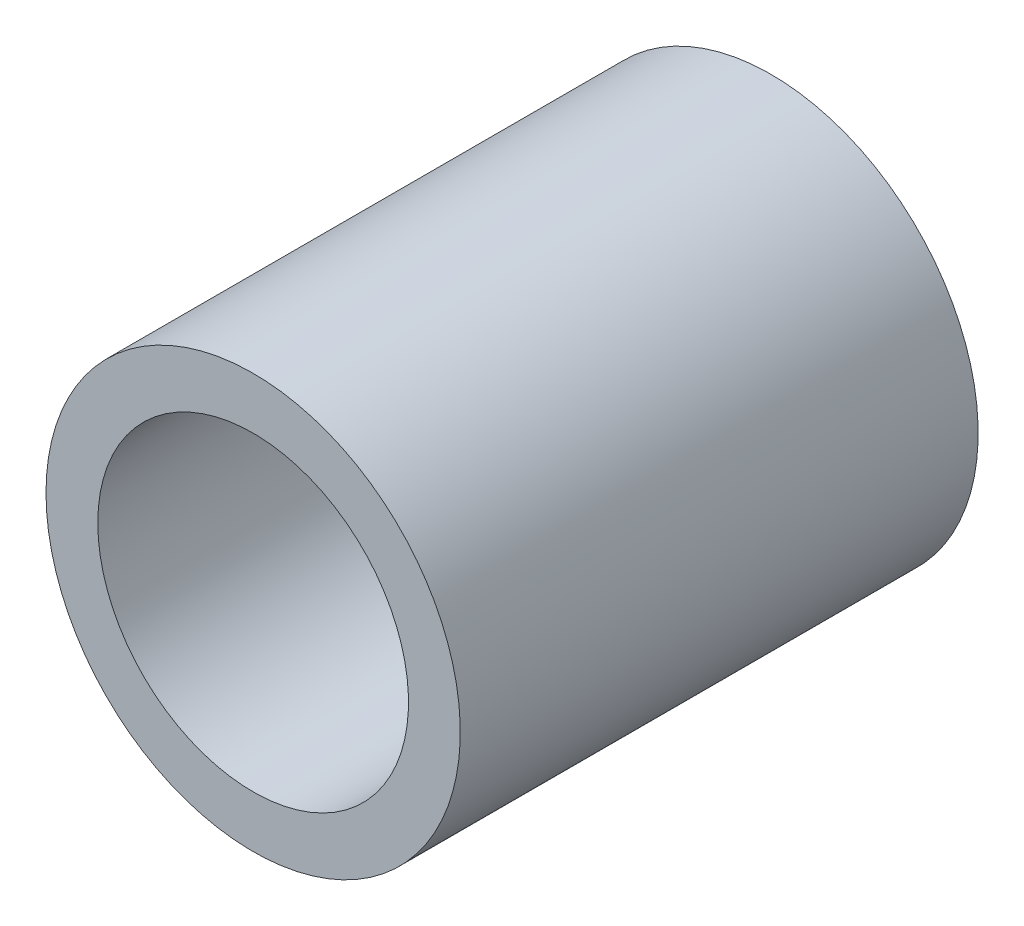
from build123d import *

# Parameters (mm, degrees)
ESQUISSE1_R      = 4
ESQUISSE1_R_2    = 3
EXTRUSION1_DEPTH = 10


with BuildPart() as part:
    # Esquisse1 → Extrusion1 (new body)
    with BuildSketch(Plane.XY):
        Circle(ESQUISSE1_R)
        Circle(ESQUISSE1_R_2, mode=Mode.SUBTRACT)
    extrude(amount=EXTRUSION1_DEPTH)


solid = part.part
